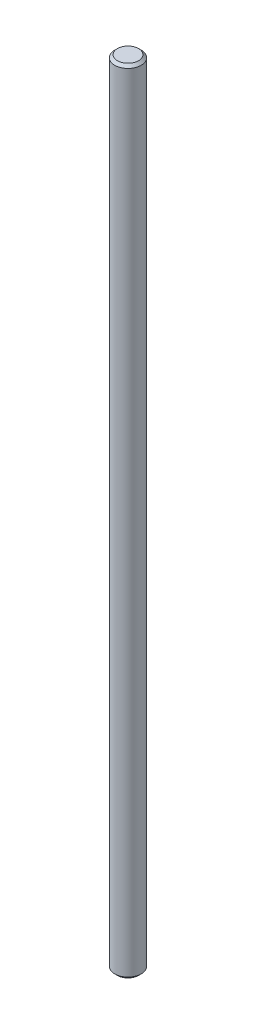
from build123d import *

# Parameters (mm, degrees)
SKETCH1_R      = 2
EXTRUDE1_DEPTH = 120
CHAMFER1_SIZE  = 0.4


with BuildPart() as part:
    # Sketch1 → Extrude1 (new body)
    with BuildSketch(Plane(origin=(0, 0, 0), x_dir=(1, 0, 0), z_dir=(0, 1, 0))):
        with Locations(Location((0, 0, 0), (0, 0, 270))):
            Circle(SKETCH1_R)
    extrude(amount=EXTRUDE1_DEPTH)

    # Chamfer1
    chamfer1_edges = [part.edges().sort_by_distance(p)[0] for p in [
        (0, 0, -2),
        (0, 120, -2),
    ]]
    chamfer(chamfer1_edges, length=CHAMFER1_SIZE)


solid = part.part
